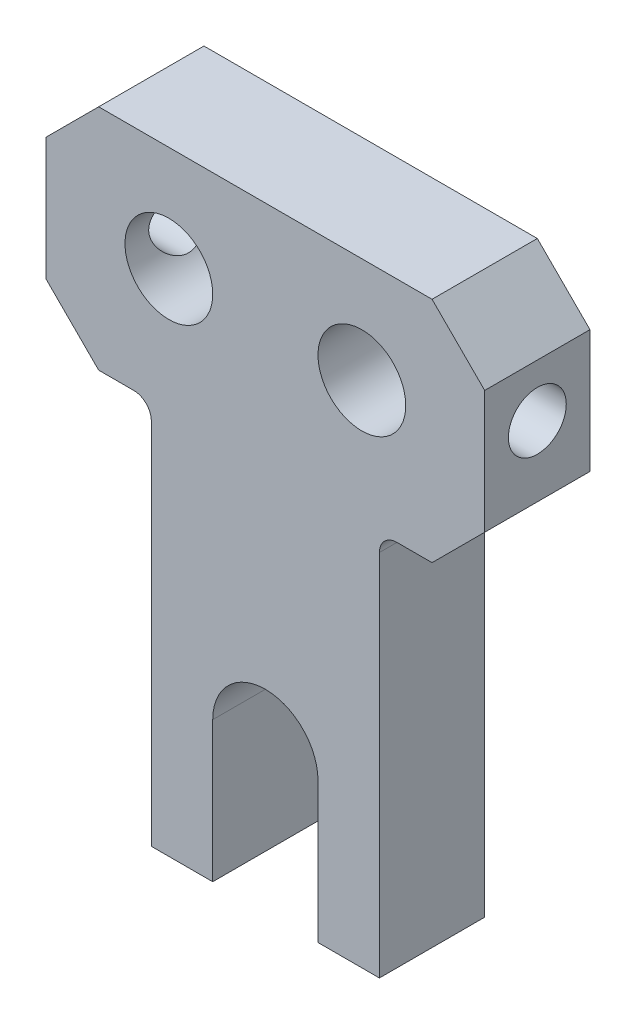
ISO-10303-21;
HEADER;
FILE_DESCRIPTION(('STEP AP214'),'2;1');
FILE_NAME('part.step','',(''),(''),'','','');
FILE_SCHEMA(('AUTOMOTIVE_DESIGN { 1 0 10303 214 1 1 1 1 }'));
ENDSEC;
DATA;
#1=APPLICATION_CONTEXT('core data for automotive mechanical design processes');
#2=APPLICATION_PROTOCOL_DEFINITION('international standard','automotive_design',2000,#1);
#3=PRODUCT_CONTEXT('',#1,'mechanical');
#4=PRODUCT('Part','Part','',(#3));
#5=PRODUCT_RELATED_PRODUCT_CATEGORY('part','',(#4));
#6=PRODUCT_DEFINITION_FORMATION('','',#4);
#7=PRODUCT_DEFINITION_CONTEXT('part definition',#1,'design');
#8=PRODUCT_DEFINITION('design','',#6,#7);
#9=PRODUCT_DEFINITION_SHAPE('','',#8);
#10=(LENGTH_UNIT() NAMED_UNIT(*) SI_UNIT(.MILLI.,.METRE.));
#11=(NAMED_UNIT(*) PLANE_ANGLE_UNIT() SI_UNIT($,.RADIAN.));
#12=(NAMED_UNIT(*) SI_UNIT($,.STERADIAN.) SOLID_ANGLE_UNIT());
#13=UNCERTAINTY_MEASURE_WITH_UNIT(LENGTH_MEASURE(1.E-05),#10,'distance_accuracy_value','');
#14=(GEOMETRIC_REPRESENTATION_CONTEXT(3) GLOBAL_UNCERTAINTY_ASSIGNED_CONTEXT((#13)) GLOBAL_UNIT_ASSIGNED_CONTEXT((#10,
#11,#12)) REPRESENTATION_CONTEXT('',''));
#15=CARTESIAN_POINT('',(0.,0.,0.));
#16=DIRECTION('',(0.,0.,1.));
#17=DIRECTION('',(1.,0.,0.));
#18=AXIS2_PLACEMENT_3D('',#15,#16,#17);
#19=CARTESIAN_POINT('',(0.,-107.763002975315,6.));
#20=DIRECTION('',(0.,1.,0.));
#21=DIRECTION('',(0.,0.,1.));
#22=AXIS2_PLACEMENT_3D('',#19,#20,#21);
#23=PLANE('',#22);
#24=DIRECTION('',(1.,0.,0.));
#25=VECTOR('',#24,1.);
#26=CARTESIAN_POINT('',(0.,-107.763002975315,0.));
#27=LINE('',#26,#25);
#28=CARTESIAN_POINT('',(6.,-107.763002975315,0.));
#29=VERTEX_POINT('',#28);
#30=CARTESIAN_POINT('',(9.5,-107.763002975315,0.));
#31=VERTEX_POINT('',#30);
#32=EDGE_CURVE('E167',#29,#31,#27,.T.);
#33=ORIENTED_EDGE('',*,*,#32,.T.);
#34=DIRECTION('',(0.,0.,1.));
#35=VECTOR('',#34,1.);
#36=CARTESIAN_POINT('',(9.5,-107.763002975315,0.));
#37=LINE('',#36,#35);
#38=CARTESIAN_POINT('',(9.5,-107.763002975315,6.));
#39=VERTEX_POINT('',#38);
#40=EDGE_CURVE('E379',#31,#39,#37,.T.);
#41=ORIENTED_EDGE('',*,*,#40,.T.);
#42=DIRECTION('',(1.,0.,0.));
#43=VECTOR('',#42,1.);
#44=CARTESIAN_POINT('',(0.,-107.763002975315,6.));
#45=LINE('',#44,#43);
#46=CARTESIAN_POINT('',(6.,-107.763002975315,6.));
#47=VERTEX_POINT('',#46);
#48=EDGE_CURVE('E299',#47,#39,#45,.T.);
#49=ORIENTED_EDGE('',*,*,#48,.F.);
#50=DIRECTION('',(0.,0.,1.));
#51=VECTOR('',#50,1.);
#52=CARTESIAN_POINT('',(6.,-107.763002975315,0.));
#53=LINE('',#52,#51);
#54=EDGE_CURVE('E394',#29,#47,#53,.T.);
#55=ORIENTED_EDGE('',*,*,#54,.F.);
#56=EDGE_LOOP('',(#33,#41,#49,#55));
#57=FACE_BOUND('',#56,.T.);
#58=ADVANCED_FACE('F16',(#57),#23,.F.);
#59=CARTESIAN_POINT('',(0.,-72.7630029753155,6.));
#60=DIRECTION('',(1.,0.,0.));
#61=DIRECTION('',(0.,1.,0.));
#62=AXIS2_PLACEMENT_3D('',#59,#60,#61);
#63=PLANE('',#62);
#64=CARTESIAN_POINT('',(0.,-78.7630029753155,3.));
#65=DIRECTION('',(-1.,0.,0.));
#66=DIRECTION('',(0.,0.,1.));
#67=AXIS2_PLACEMENT_3D('',#64,#65,#66);
#68=CIRCLE('',#67,1.65);
#69=CARTESIAN_POINT('',(0.,-78.7630029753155,4.65));
#70=VERTEX_POINT('',#69);
#71=EDGE_CURVE('E419',#70,#70,#68,.T.);
#72=ORIENTED_EDGE('',*,*,#71,.F.);
#73=EDGE_LOOP('',(#72));
#74=FACE_BOUND('',#73,.T.);
#75=DIRECTION('',(0.,-1.,0.));
#76=VECTOR('',#75,1.);
#77=CARTESIAN_POINT('',(0.,-72.7630029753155,0.));
#78=LINE('',#77,#76);
#79=CARTESIAN_POINT('',(0.,-75.7630029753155,0.));
#80=VERTEX_POINT('',#79);
#81=CARTESIAN_POINT('',(0.,-82.7630029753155,0.));
#82=VERTEX_POINT('',#81);
#83=EDGE_CURVE('E168',#80,#82,#78,.T.);
#84=ORIENTED_EDGE('',*,*,#83,.T.);
#85=DIRECTION('',(0.,0.,1.));
#86=VECTOR('',#85,1.);
#87=CARTESIAN_POINT('',(0.,-82.7630029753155,6.));
#88=LINE('',#87,#86);
#89=CARTESIAN_POINT('',(0.,-82.7630029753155,6.));
#90=VERTEX_POINT('',#89);
#91=EDGE_CURVE('E310',#82,#90,#88,.T.);
#92=ORIENTED_EDGE('',*,*,#91,.T.);
#93=DIRECTION('',(0.,-1.,0.));
#94=VECTOR('',#93,1.);
#95=CARTESIAN_POINT('',(0.,-72.7630029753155,6.));
#96=LINE('',#95,#94);
#97=CARTESIAN_POINT('',(0.,-75.7630029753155,6.));
#98=VERTEX_POINT('',#97);
#99=EDGE_CURVE('E182',#98,#90,#96,.T.);
#100=ORIENTED_EDGE('',*,*,#99,.F.);
#101=DIRECTION('',(0.,0.,-1.));
#102=VECTOR('',#101,1.);
#103=CARTESIAN_POINT('',(0.,-75.7630029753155,6.));
#104=LINE('',#103,#102);
#105=EDGE_CURVE('E306',#98,#80,#104,.T.);
#106=ORIENTED_EDGE('',*,*,#105,.T.);
#107=EDGE_LOOP('',(#84,#92,#100,#106));
#108=FACE_BOUND('',#107,.T.);
#109=ADVANCED_FACE('F238',(#74,#108),#63,.F.);
#110=CARTESIAN_POINT('',(15.5,-107.763002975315,6.));
#111=VERTEX_POINT('',#110);
#112=CARTESIAN_POINT('',(19.,-107.763002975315,6.));
#113=VERTEX_POINT('',#112);
#114=EDGE_CURVE('E161',#111,#113,#45,.T.);
#115=ORIENTED_EDGE('',*,*,#114,.F.);
#116=DIRECTION('',(0.,0.,1.));
#117=VECTOR('',#116,1.);
#118=CARTESIAN_POINT('',(15.5,-107.763002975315,0.));
#119=LINE('',#118,#117);
#120=CARTESIAN_POINT('',(15.5,-107.763002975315,0.));
#121=VERTEX_POINT('',#120);
#122=EDGE_CURVE('E144',#121,#111,#119,.T.);
#123=ORIENTED_EDGE('',*,*,#122,.F.);
#124=CARTESIAN_POINT('',(19.,-107.763002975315,0.));
#125=VERTEX_POINT('',#124);
#126=EDGE_CURVE('E158',#121,#125,#27,.T.);
#127=ORIENTED_EDGE('',*,*,#126,.T.);
#128=DIRECTION('',(0.,0.,1.));
#129=VECTOR('',#128,1.);
#130=CARTESIAN_POINT('',(19.,-107.763002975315,0.));
#131=LINE('',#130,#129);
#132=EDGE_CURVE('E370',#125,#113,#131,.T.);
#133=ORIENTED_EDGE('',*,*,#132,.T.);
#134=EDGE_LOOP('',(#115,#123,#127,#133));
#135=FACE_BOUND('',#134,.T.);
#136=ADVANCED_FACE('F156',(#135),#23,.F.);
#137=CARTESIAN_POINT('',(25.,-72.7630029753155,6.));
#138=DIRECTION('',(-1.,0.,0.));
#139=DIRECTION('',(0.,0.,1.));
#140=AXIS2_PLACEMENT_3D('',#137,#138,#139);
#141=PLANE('',#140);
#142=CARTESIAN_POINT('',(25.,-78.7630029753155,3.));
#143=DIRECTION('',(1.,0.,0.));
#144=DIRECTION('',(0.,0.,-1.));
#145=AXIS2_PLACEMENT_3D('',#142,#143,#144);
#146=CIRCLE('',#145,1.65);
#147=CARTESIAN_POINT('',(25.,-78.7630029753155,1.35));
#148=VERTEX_POINT('',#147);
#149=EDGE_CURVE('E192',#148,#148,#146,.T.);
#150=ORIENTED_EDGE('',*,*,#149,.F.);
#151=EDGE_LOOP('',(#150));
#152=FACE_BOUND('',#151,.T.);
#153=DIRECTION('',(0.,1.,0.));
#154=VECTOR('',#153,1.);
#155=CARTESIAN_POINT('',(25.,-72.7630029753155,6.));
#156=LINE('',#155,#154);
#157=CARTESIAN_POINT('',(25.,-82.7630029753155,6.));
#158=VERTEX_POINT('',#157);
#159=CARTESIAN_POINT('',(25.,-75.7630029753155,6.));
#160=VERTEX_POINT('',#159);
#161=EDGE_CURVE('E302',#158,#160,#156,.T.);
#162=ORIENTED_EDGE('',*,*,#161,.F.);
#163=DIRECTION('',(0.,0.,-1.));
#164=VECTOR('',#163,1.);
#165=CARTESIAN_POINT('',(25.,-82.7630029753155,6.));
#166=LINE('',#165,#164);
#167=CARTESIAN_POINT('',(25.,-82.7630029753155,0.));
#168=VERTEX_POINT('',#167);
#169=EDGE_CURVE('E348',#158,#168,#166,.T.);
#170=ORIENTED_EDGE('',*,*,#169,.T.);
#171=DIRECTION('',(0.,1.,0.));
#172=VECTOR('',#171,1.);
#173=CARTESIAN_POINT('',(25.,-72.7630029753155,0.));
#174=LINE('',#173,#172);
#175=CARTESIAN_POINT('',(25.,-75.7630029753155,0.));
#176=VERTEX_POINT('',#175);
#177=EDGE_CURVE('E171',#168,#176,#174,.T.);
#178=ORIENTED_EDGE('',*,*,#177,.T.);
#179=DIRECTION('',(0.,0.,1.));
#180=VECTOR('',#179,1.);
#181=CARTESIAN_POINT('',(25.,-75.7630029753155,6.));
#182=LINE('',#181,#180);
#183=EDGE_CURVE('E346',#176,#160,#182,.T.);
#184=ORIENTED_EDGE('',*,*,#183,.T.);
#185=EDGE_LOOP('',(#162,#170,#178,#184));
#186=FACE_BOUND('',#185,.T.);
#187=ADVANCED_FACE('F249',(#152,#186),#141,.F.);
#188=CARTESIAN_POINT('',(0.,-72.7630029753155,6.));
#189=DIRECTION('',(0.,-1.,0.));
#190=DIRECTION('',(0.,0.,-1.));
#191=AXIS2_PLACEMENT_3D('',#188,#189,#190);
#192=PLANE('',#191);
#193=DIRECTION('',(-1.,0.,0.));
#194=VECTOR('',#193,1.);
#195=CARTESIAN_POINT('',(0.,-72.7630029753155,0.));
#196=LINE('',#195,#194);
#197=CARTESIAN_POINT('',(22.,-72.7630029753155,0.));
#198=VERTEX_POINT('',#197);
#199=CARTESIAN_POINT('',(3.,-72.7630029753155,0.));
#200=VERTEX_POINT('',#199);
#201=EDGE_CURVE('E179',#198,#200,#196,.T.);
#202=ORIENTED_EDGE('',*,*,#201,.T.);
#203=DIRECTION('',(0.,0.,1.));
#204=VECTOR('',#203,1.);
#205=CARTESIAN_POINT('',(3.,-72.7630029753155,6.));
#206=LINE('',#205,#204);
#207=CARTESIAN_POINT('',(3.,-72.7630029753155,6.));
#208=VERTEX_POINT('',#207);
#209=EDGE_CURVE('E341',#200,#208,#206,.T.);
#210=ORIENTED_EDGE('',*,*,#209,.T.);
#211=DIRECTION('',(-1.,0.,0.));
#212=VECTOR('',#211,1.);
#213=CARTESIAN_POINT('',(0.,-72.7630029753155,6.));
#214=LINE('',#213,#212);
#215=CARTESIAN_POINT('',(22.,-72.7630029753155,6.));
#216=VERTEX_POINT('',#215);
#217=EDGE_CURVE('E304',#216,#208,#214,.T.);
#218=ORIENTED_EDGE('',*,*,#217,.F.);
#219=DIRECTION('',(0.,0.,-1.));
#220=VECTOR('',#219,1.);
#221=CARTESIAN_POINT('',(22.,-72.7630029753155,6.));
#222=LINE('',#221,#220);
#223=EDGE_CURVE('E338',#216,#198,#222,.T.);
#224=ORIENTED_EDGE('',*,*,#223,.T.);
#225=EDGE_LOOP('',(#202,#210,#218,#224));
#226=FACE_BOUND('',#225,.T.);
#227=ADVANCED_FACE('F254',(#226),#192,.F.);
#228=CARTESIAN_POINT('',(0.,0.,6.));
#229=DIRECTION('',(0.,0.,1.));
#230=DIRECTION('',(1.,0.,0.));
#231=AXIS2_PLACEMENT_3D('',#228,#229,#230);
#232=PLANE('',#231);
#233=ORIENTED_EDGE('',*,*,#99,.T.);
#234=DIRECTION('',(-0.70710678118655,0.707106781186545,0.));
#235=VECTOR('',#234,1.);
#236=CARTESIAN_POINT('',(-41.3815014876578,-41.381501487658,6.));
#237=LINE('',#236,#235);
#238=CARTESIAN_POINT('',(3.,-85.7630029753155,6.));
#239=VERTEX_POINT('',#238);
#240=EDGE_CURVE('E324',#90,#239,#237,.F.);
#241=ORIENTED_EDGE('',*,*,#240,.T.);
#242=DIRECTION('',(-1.,0.,0.));
#243=VECTOR('',#242,1.);
#244=CARTESIAN_POINT('',(0.,-85.7630029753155,6.));
#245=LINE('',#244,#243);
#246=CARTESIAN_POINT('',(5.,-85.7630029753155,6.));
#247=VERTEX_POINT('',#246);
#248=EDGE_CURVE('E392',#247,#239,#245,.T.);
#249=ORIENTED_EDGE('',*,*,#248,.F.);
#250=CARTESIAN_POINT('',(5.,-86.7630029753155,6.));
#251=DIRECTION('',(0.,0.,1.));
#252=DIRECTION('',(1.,0.,0.));
#253=AXIS2_PLACEMENT_3D('',#250,#251,#252);
#254=CIRCLE('',#253,1.);
#255=CARTESIAN_POINT('',(6.,-86.7630029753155,6.));
#256=VERTEX_POINT('',#255);
#257=EDGE_CURVE('E24',#247,#256,#254,.F.);
#258=ORIENTED_EDGE('',*,*,#257,.T.);
#259=DIRECTION('',(0.,1.,0.));
#260=VECTOR('',#259,1.);
#261=CARTESIAN_POINT('',(6.,-107.763002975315,6.));
#262=LINE('',#261,#260);
#263=EDGE_CURVE('E388',#47,#256,#262,.T.);
#264=ORIENTED_EDGE('',*,*,#263,.F.);
#265=ORIENTED_EDGE('',*,*,#48,.T.);
#266=DIRECTION('',(0.,-1.,0.));
#267=VECTOR('',#266,1.);
#268=CARTESIAN_POINT('',(9.5,-107.763002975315,6.));
#269=LINE('',#268,#267);
#270=CARTESIAN_POINT('',(9.5,-99.7630029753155,6.));
#271=VERTEX_POINT('',#270);
#272=EDGE_CURVE('E151',#271,#39,#269,.T.);
#273=ORIENTED_EDGE('',*,*,#272,.F.);
#274=CARTESIAN_POINT('',(12.5,-99.7630029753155,6.));
#275=DIRECTION('',(0.,0.,1.));
#276=DIRECTION('',(1.,0.,0.));
#277=AXIS2_PLACEMENT_3D('',#274,#275,#276);
#278=CIRCLE('',#277,3.);
#279=CARTESIAN_POINT('',(15.5,-99.7630029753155,6.));
#280=VERTEX_POINT('',#279);
#281=EDGE_CURVE('E410',#280,#271,#278,.T.);
#282=ORIENTED_EDGE('',*,*,#281,.F.);
#283=DIRECTION('',(0.,1.,0.));
#284=VECTOR('',#283,1.);
#285=CARTESIAN_POINT('',(15.5,-107.763002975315,6.));
#286=LINE('',#285,#284);
#287=EDGE_CURVE('E191',#111,#280,#286,.T.);
#288=ORIENTED_EDGE('',*,*,#287,.F.);
#289=ORIENTED_EDGE('',*,*,#114,.T.);
#290=DIRECTION('',(0.,-1.,0.));
#291=VECTOR('',#290,1.);
#292=CARTESIAN_POINT('',(19.,-107.763002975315,6.));
#293=LINE('',#292,#291);
#294=CARTESIAN_POINT('',(19.,-86.7630029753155,6.));
#295=VERTEX_POINT('',#294);
#296=EDGE_CURVE('E377',#295,#113,#293,.T.);
#297=ORIENTED_EDGE('',*,*,#296,.F.);
#298=CARTESIAN_POINT('',(20.,-86.7630029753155,6.));
#299=DIRECTION('',(0.,0.,1.));
#300=DIRECTION('',(1.,0.,0.));
#301=AXIS2_PLACEMENT_3D('',#298,#299,#300);
#302=CIRCLE('',#301,1.);
#303=CARTESIAN_POINT('',(20.,-85.7630029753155,6.));
#304=VERTEX_POINT('',#303);
#305=EDGE_CURVE('E359',#295,#304,#302,.F.);
#306=ORIENTED_EDGE('',*,*,#305,.T.);
#307=DIRECTION('',(-1.,0.,0.));
#308=VECTOR('',#307,1.);
#309=CARTESIAN_POINT('',(25.,-85.7630029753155,6.));
#310=LINE('',#309,#308);
#311=CARTESIAN_POINT('',(22.,-85.7630029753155,6.));
#312=VERTEX_POINT('',#311);
#313=EDGE_CURVE('E376',#312,#304,#310,.T.);
#314=ORIENTED_EDGE('',*,*,#313,.F.);
#315=DIRECTION('',(-0.707106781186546,-0.707106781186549,0.));
#316=VECTOR('',#315,1.);
#317=CARTESIAN_POINT('',(53.8815014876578,-53.8815014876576,6.));
#318=LINE('',#317,#316);
#319=EDGE_CURVE('E320',#312,#158,#318,.F.);
#320=ORIENTED_EDGE('',*,*,#319,.T.);
#321=ORIENTED_EDGE('',*,*,#161,.T.);
#322=DIRECTION('',(0.707106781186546,-0.707106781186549,0.));
#323=VECTOR('',#322,1.);
#324=CARTESIAN_POINT('',(-25.3815014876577,-25.3815014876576,6.));
#325=LINE('',#324,#323);
#326=EDGE_CURVE('E316',#160,#216,#325,.F.);
#327=ORIENTED_EDGE('',*,*,#326,.T.);
#328=ORIENTED_EDGE('',*,*,#217,.T.);
#329=DIRECTION('',(0.70710678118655,0.707106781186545,0.));
#330=VECTOR('',#329,1.);
#331=CARTESIAN_POINT('',(37.8815014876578,-37.881501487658,6.));
#332=LINE('',#331,#330);
#333=EDGE_CURVE('E322',#208,#98,#332,.F.);
#334=ORIENTED_EDGE('',*,*,#333,.T.);
#335=EDGE_LOOP('',(#233,#241,#249,#258,#264,#265,#273,#282,#288,#289,#297,#306,#314,#320,#321,
#327,#328,#334));
#336=FACE_BOUND('',#335,.T.);
#337=CARTESIAN_POINT('',(18.,-78.7630029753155,6.));
#338=DIRECTION('',(0.,0.,1.));
#339=DIRECTION('',(1.,0.,0.));
#340=AXIS2_PLACEMENT_3D('',#337,#338,#339);
#341=CIRCLE('',#340,2.5);
#342=CARTESIAN_POINT('',(20.5,-78.7630029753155,6.));
#343=VERTEX_POINT('',#342);
#344=EDGE_CURVE('E293',#343,#343,#341,.T.);
#345=ORIENTED_EDGE('',*,*,#344,.F.);
#346=EDGE_LOOP('',(#345));
#347=FACE_BOUND('',#346,.T.);
#348=CARTESIAN_POINT('',(7.,-78.7630029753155,6.));
#349=DIRECTION('',(0.,0.,1.));
#350=DIRECTION('',(1.,0.,0.));
#351=AXIS2_PLACEMENT_3D('',#348,#349,#350);
#352=CIRCLE('',#351,2.5);
#353=CARTESIAN_POINT('',(9.5,-78.7630029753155,6.));
#354=VERTEX_POINT('',#353);
#355=EDGE_CURVE('E287',#354,#354,#352,.T.);
#356=ORIENTED_EDGE('',*,*,#355,.F.);
#357=EDGE_LOOP('',(#356));
#358=FACE_BOUND('',#357,.T.);
#359=ADVANCED_FACE('F260',(#336,#347,#358),#232,.T.);
#360=CARTESIAN_POINT('',(0.,0.,0.));
#361=DIRECTION('',(0.,0.,1.));
#362=DIRECTION('',(1.,0.,0.));
#363=AXIS2_PLACEMENT_3D('',#360,#361,#362);
#364=PLANE('',#363);
#365=CARTESIAN_POINT('',(18.,-78.7630029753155,0.));
#366=DIRECTION('',(0.,0.,1.));
#367=DIRECTION('',(1.,0.,0.));
#368=AXIS2_PLACEMENT_3D('',#365,#366,#367);
#369=CIRCLE('',#368,2.5);
#370=CARTESIAN_POINT('',(20.5,-78.7630029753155,0.));
#371=VERTEX_POINT('',#370);
#372=EDGE_CURVE('E289',#371,#371,#369,.T.);
#373=ORIENTED_EDGE('',*,*,#372,.T.);
#374=EDGE_LOOP('',(#373));
#375=FACE_BOUND('',#374,.T.);
#376=CARTESIAN_POINT('',(7.,-78.7630029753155,0.));
#377=DIRECTION('',(0.,0.,1.));
#378=DIRECTION('',(1.,0.,0.));
#379=AXIS2_PLACEMENT_3D('',#376,#377,#378);
#380=CIRCLE('',#379,2.5);
#381=CARTESIAN_POINT('',(9.5,-78.7630029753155,0.));
#382=VERTEX_POINT('',#381);
#383=EDGE_CURVE('E173',#382,#382,#380,.T.);
#384=ORIENTED_EDGE('',*,*,#383,.T.);
#385=EDGE_LOOP('',(#384));
#386=FACE_BOUND('',#385,.T.);
#387=DIRECTION('',(0.,1.,0.));
#388=VECTOR('',#387,1.);
#389=CARTESIAN_POINT('',(6.,-107.763002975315,0.));
#390=LINE('',#389,#388);
#391=CARTESIAN_POINT('',(6.,-86.7630029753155,0.));
#392=VERTEX_POINT('',#391);
#393=EDGE_CURVE('E389',#29,#392,#390,.T.);
#394=ORIENTED_EDGE('',*,*,#393,.T.);
#395=CARTESIAN_POINT('',(5.,-86.7630029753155,0.));
#396=DIRECTION('',(0.,0.,1.));
#397=DIRECTION('',(1.,0.,0.));
#398=AXIS2_PLACEMENT_3D('',#395,#396,#397);
#399=CIRCLE('',#398,1.);
#400=CARTESIAN_POINT('',(5.,-85.7630029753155,0.));
#401=VERTEX_POINT('',#400);
#402=EDGE_CURVE('E11',#392,#401,#399,.T.);
#403=ORIENTED_EDGE('',*,*,#402,.T.);
#404=DIRECTION('',(-1.,0.,0.));
#405=VECTOR('',#404,1.);
#406=CARTESIAN_POINT('',(0.,-85.7630029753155,0.));
#407=LINE('',#406,#405);
#408=CARTESIAN_POINT('',(3.,-85.7630029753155,0.));
#409=VERTEX_POINT('',#408);
#410=EDGE_CURVE('E391',#401,#409,#407,.T.);
#411=ORIENTED_EDGE('',*,*,#410,.T.);
#412=DIRECTION('',(0.70710678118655,-0.707106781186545,0.));
#413=VECTOR('',#412,1.);
#414=CARTESIAN_POINT('',(0.,-82.7630029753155,0.));
#415=LINE('',#414,#413);
#416=EDGE_CURVE('E336',#409,#82,#415,.F.);
#417=ORIENTED_EDGE('',*,*,#416,.T.);
#418=ORIENTED_EDGE('',*,*,#83,.F.);
#419=DIRECTION('',(-0.70710678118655,-0.707106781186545,0.));
#420=VECTOR('',#419,1.);
#421=CARTESIAN_POINT('',(0.,-75.7630029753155,0.));
#422=LINE('',#421,#420);
#423=EDGE_CURVE('E334',#80,#200,#422,.F.);
#424=ORIENTED_EDGE('',*,*,#423,.T.);
#425=ORIENTED_EDGE('',*,*,#201,.F.);
#426=DIRECTION('',(-0.707106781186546,0.707106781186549,0.));
#427=VECTOR('',#426,1.);
#428=CARTESIAN_POINT('',(22.,-72.7630029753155,0.));
#429=LINE('',#428,#427);
#430=EDGE_CURVE('E330',#198,#176,#429,.F.);
#431=ORIENTED_EDGE('',*,*,#430,.T.);
#432=ORIENTED_EDGE('',*,*,#177,.F.);
#433=DIRECTION('',(0.707106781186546,0.707106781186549,0.));
#434=VECTOR('',#433,1.);
#435=CARTESIAN_POINT('',(22.,-85.7630029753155,0.));
#436=LINE('',#435,#434);
#437=CARTESIAN_POINT('',(22.,-85.7630029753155,0.));
#438=VERTEX_POINT('',#437);
#439=EDGE_CURVE('E332',#168,#438,#436,.F.);
#440=ORIENTED_EDGE('',*,*,#439,.T.);
#441=DIRECTION('',(-1.,0.,0.));
#442=VECTOR('',#441,1.);
#443=CARTESIAN_POINT('',(25.,-85.7630029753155,0.));
#444=LINE('',#443,#442);
#445=CARTESIAN_POINT('',(20.,-85.7630029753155,0.));
#446=VERTEX_POINT('',#445);
#447=EDGE_CURVE('E365',#438,#446,#444,.T.);
#448=ORIENTED_EDGE('',*,*,#447,.T.);
#449=CARTESIAN_POINT('',(20.,-86.7630029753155,0.));
#450=DIRECTION('',(0.,0.,1.));
#451=DIRECTION('',(1.,0.,0.));
#452=AXIS2_PLACEMENT_3D('',#449,#450,#451);
#453=CIRCLE('',#452,1.);
#454=CARTESIAN_POINT('',(19.,-86.7630029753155,0.));
#455=VERTEX_POINT('',#454);
#456=EDGE_CURVE('E361',#446,#455,#453,.T.);
#457=ORIENTED_EDGE('',*,*,#456,.T.);
#458=DIRECTION('',(0.,-1.,0.));
#459=VECTOR('',#458,1.);
#460=CARTESIAN_POINT('',(19.,-107.763002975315,0.));
#461=LINE('',#460,#459);
#462=EDGE_CURVE('E166',#455,#125,#461,.T.);
#463=ORIENTED_EDGE('',*,*,#462,.T.);
#464=ORIENTED_EDGE('',*,*,#126,.F.);
#465=DIRECTION('',(0.,1.,0.));
#466=VECTOR('',#465,1.);
#467=CARTESIAN_POINT('',(15.5,-107.763002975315,0.));
#468=LINE('',#467,#466);
#469=CARTESIAN_POINT('',(15.5,-99.7630029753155,0.));
#470=VERTEX_POINT('',#469);
#471=EDGE_CURVE('E140',#121,#470,#468,.T.);
#472=ORIENTED_EDGE('',*,*,#471,.T.);
#473=CARTESIAN_POINT('',(12.5,-99.7630029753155,0.));
#474=DIRECTION('',(0.,0.,1.));
#475=DIRECTION('',(1.,0.,0.));
#476=AXIS2_PLACEMENT_3D('',#473,#474,#475);
#477=CIRCLE('',#476,3.);
#478=CARTESIAN_POINT('',(9.5,-99.7630029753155,0.));
#479=VERTEX_POINT('',#478);
#480=EDGE_CURVE('E150',#470,#479,#477,.T.);
#481=ORIENTED_EDGE('',*,*,#480,.T.);
#482=DIRECTION('',(0.,-1.,0.));
#483=VECTOR('',#482,1.);
#484=CARTESIAN_POINT('',(9.5,-107.763002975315,0.));
#485=LINE('',#484,#483);
#486=EDGE_CURVE('E162',#479,#31,#485,.T.);
#487=ORIENTED_EDGE('',*,*,#486,.T.);
#488=ORIENTED_EDGE('',*,*,#32,.F.);
#489=EDGE_LOOP('',(#394,#403,#411,#417,#418,#424,#425,#431,#432,#440,#448,#457,#463,#464,#472,
#481,#487,#488));
#490=FACE_BOUND('',#489,.T.);
#491=ADVANCED_FACE('F164',(#375,#386,#490),#364,.F.);
#492=CARTESIAN_POINT('',(7.,-78.7630029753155,0.));
#493=DIRECTION('',(0.,0.,1.));
#494=DIRECTION('',(1.,0.,0.));
#495=AXIS2_PLACEMENT_3D('',#492,#493,#494);
#496=CYLINDRICAL_SURFACE('',#495,2.5);
#497=CARTESIAN_POINT('',(4.5,-78.7630029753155,4.65));
#498=CARTESIAN_POINT('',(4.50000126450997,-78.6799455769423,4.64999873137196));
#499=CARTESIAN_POINT('',(4.50417590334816,-78.5968759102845,4.64369332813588));
#500=CARTESIAN_POINT('',(4.52046206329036,-78.43337541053,4.61885588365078));
#501=CARTESIAN_POINT('',(4.53257847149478,-78.3529462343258,4.60031631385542));
#502=CARTESIAN_POINT('',(4.56354921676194,-78.1973361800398,4.5521372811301));
#503=CARTESIAN_POINT('',(4.58237189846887,-78.1221325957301,4.52254993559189));
#504=CARTESIAN_POINT('',(4.62523480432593,-77.9780520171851,4.45352693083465));
#505=CARTESIAN_POINT('',(4.64927570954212,-77.909175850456,4.41408998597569));
#506=CARTESIAN_POINT('',(4.70304338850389,-77.7731661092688,4.32286952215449));
#507=CARTESIAN_POINT('',(4.73307831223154,-77.7066662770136,4.27032656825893));
#508=CARTESIAN_POINT('',(4.79501154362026,-77.5828201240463,4.15618952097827));
#509=CARTESIAN_POINT('',(4.82691244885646,-77.5254869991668,4.09458262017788));
#510=CARTESIAN_POINT('',(4.89493215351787,-77.4125714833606,3.95302539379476));
#511=CARTESIAN_POINT('',(4.93094323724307,-77.3586208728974,3.87171133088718));
#512=CARTESIAN_POINT('',(4.99750748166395,-77.2652330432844,3.69912083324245));
#513=CARTESIAN_POINT('',(5.02807003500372,-77.2257707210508,3.60786198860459));
#514=CARTESIAN_POINT('',(5.07115995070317,-77.1722780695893,3.44413560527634));
#515=CARTESIAN_POINT('',(5.08634429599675,-77.1542077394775,3.37369396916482));
#516=CARTESIAN_POINT('',(5.10914156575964,-77.1274689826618,3.22990185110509));
#517=CARTESIAN_POINT('',(5.11676714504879,-77.1187848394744,3.15655644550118));
#518=CARTESIAN_POINT('',(5.1232724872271,-77.1113603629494,3.00867667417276));
#519=CARTESIAN_POINT('',(5.12211886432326,-77.1126579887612,2.93413884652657));
#520=CARTESIAN_POINT('',(5.1111810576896,-77.1251918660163,2.78652353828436));
#521=CARTESIAN_POINT('',(5.10138958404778,-77.1364365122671,2.71344734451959));
#522=CARTESIAN_POINT('',(5.0752285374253,-77.1674967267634,2.57363241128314));
#523=CARTESIAN_POINT('',(5.05913987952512,-77.1869487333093,2.50675695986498));
#524=CARTESIAN_POINT('',(5.02222991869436,-77.2335238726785,2.37715045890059));
#525=CARTESIAN_POINT('',(5.00140706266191,-77.2606495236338,2.31442077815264));
#526=CARTESIAN_POINT('',(4.95232655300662,-77.3280473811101,2.18145090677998));
#527=CARTESIAN_POINT('',(4.92341588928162,-77.3698664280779,2.112237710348));
#528=CARTESIAN_POINT('',(4.8640181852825,-77.4627609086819,1.98100806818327));
#529=CARTESIAN_POINT('',(4.83352924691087,-77.5138476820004,1.91900059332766));
#530=CARTESIAN_POINT('',(4.76704742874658,-77.6361862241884,1.79079581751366));
#531=CARTESIAN_POINT('',(4.73122080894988,-77.7094232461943,1.72638563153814));
#532=CARTESIAN_POINT('',(4.66430895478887,-77.8675178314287,1.61069375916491));
#533=CARTESIAN_POINT('',(4.63321910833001,-77.9523639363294,1.55939926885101));
#534=CARTESIAN_POINT('',(4.58446418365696,-78.1142635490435,1.4807693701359));
#535=CARTESIAN_POINT('',(4.56536086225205,-78.1895565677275,1.45070429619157));
#536=CARTESIAN_POINT('',(4.5339165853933,-78.3450269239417,1.40174403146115));
#537=CARTESIAN_POINT('',(4.52156997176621,-78.4252001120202,1.38283949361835));
#538=CARTESIAN_POINT('',(4.50473096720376,-78.5886362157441,1.35714787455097));
#539=CARTESIAN_POINT('',(4.50027049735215,-78.6719103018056,1.35041003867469));
#540=CARTESIAN_POINT('',(4.49975367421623,-78.8385484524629,1.34962658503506));
#541=CARTESIAN_POINT('',(4.50369704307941,-78.9219125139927,1.35558054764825));
#542=CARTESIAN_POINT('',(4.51905723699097,-79.0805939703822,1.37899822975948));
#543=CARTESIAN_POINT('',(4.5299651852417,-79.1560798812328,1.39567875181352));
#544=CARTESIAN_POINT('',(4.55785818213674,-79.3029430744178,1.43896514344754));
#545=CARTESIAN_POINT('',(4.5748442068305,-79.3743196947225,1.46557260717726));
#546=CARTESIAN_POINT('',(4.61490711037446,-79.5160648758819,1.52968198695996));
#547=CARTESIAN_POINT('',(4.63830561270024,-79.5860729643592,1.56777480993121));
#548=CARTESIAN_POINT('',(4.68889612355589,-79.7189654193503,1.65282892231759));
#549=CARTESIAN_POINT('',(4.71609063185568,-79.7818450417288,1.69979606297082));
#550=CARTESIAN_POINT('',(4.77691400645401,-79.9091313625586,1.80961080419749));
#551=CARTESIAN_POINT('',(4.81088232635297,-79.9722242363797,1.87379416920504));
#552=CARTESIAN_POINT('',(4.87851672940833,-80.0873009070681,2.01166557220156));
#553=CARTESIAN_POINT('',(4.91218262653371,-80.139278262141,2.08535908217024));
#554=CARTESIAN_POINT('',(4.97254094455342,-80.2265393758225,2.23370339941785));
#555=CARTESIAN_POINT('',(4.99959392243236,-80.2629694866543,2.30752954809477));
#556=CARTESIAN_POINT('',(5.04752140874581,-80.3248501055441,2.46149631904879));
#557=CARTESIAN_POINT('',(5.06840705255,-80.3503204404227,2.5416252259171));
#558=CARTESIAN_POINT('',(5.09806726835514,-80.3856849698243,2.692798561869));
#559=CARTESIAN_POINT('',(5.10828682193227,-80.3974768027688,2.76310833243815));
#560=CARTESIAN_POINT('',(5.12078129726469,-80.4118312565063,2.90533882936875));
#561=CARTESIAN_POINT('',(5.12306383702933,-80.4144027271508,2.97725794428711));
#562=CARTESIAN_POINT('',(5.11933394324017,-80.4101522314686,3.1205911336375));
#563=CARTESIAN_POINT('',(5.11332122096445,-80.4033299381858,3.19200519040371));
#564=CARTESIAN_POINT('',(5.09392209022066,-80.3807424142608,3.33240243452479));
#565=CARTESIAN_POINT('',(5.08052595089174,-80.3649653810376,3.40138228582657));
#566=CARTESIAN_POINT('',(5.0435548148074,-80.3197265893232,3.55417079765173));
#567=CARTESIAN_POINT('',(5.018185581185,-80.2876801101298,3.63677236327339));
#568=CARTESIAN_POINT('',(4.9620833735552,-80.2118359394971,3.7943942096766));
#569=CARTESIAN_POINT('',(4.93134296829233,-80.1680219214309,3.8694037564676));
#570=CARTESIAN_POINT('',(4.86735067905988,-80.0688927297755,4.01234437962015));
#571=CARTESIAN_POINT('',(4.83406471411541,-80.0133928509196,4.08013166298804));
#572=CARTESIAN_POINT('',(4.76843437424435,-79.8921058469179,4.20635347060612));
#573=CARTESIAN_POINT('',(4.73609027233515,-79.8263157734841,4.26478530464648));
#574=CARTESIAN_POINT('',(4.67115514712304,-79.6762270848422,4.37783171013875));
#575=CARTESIAN_POINT('',(4.63904646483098,-79.590640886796,4.43103774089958));
#576=CARTESIAN_POINT('',(4.58306219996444,-79.4090524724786,4.52162979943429));
#577=CARTESIAN_POINT('',(4.55917128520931,-79.3130700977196,4.55904531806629));
#578=CARTESIAN_POINT('',(4.52764430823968,-79.1410321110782,4.6078809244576));
#579=CARTESIAN_POINT('',(4.51735345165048,-79.0666677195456,4.62360538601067));
#580=CARTESIAN_POINT('',(4.50353253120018,-78.9158725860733,4.6446627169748));
#581=CARTESIAN_POINT('',(4.49999883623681,-78.8394429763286,4.65000116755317));
#582=CARTESIAN_POINT('',(4.5,-78.7630029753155,4.65));
#583=B_SPLINE_CURVE_WITH_KNOTS('',3,(#497,#498,#499,#500,#501,#502,#503,#504,#505,#506,#507,
#508,#509,#510,#511,#512,#513,#514,#515,#516,#517,#518,#519,#520,#521,#522,#523,#524,#525,#526,
#527,#528,#529,#530,#531,#532,#533,#534,#535,#536,#537,#538,#539,#540,#541,#542,#543,#544,#545,
#546,#547,#548,#549,#550,#551,#552,#553,#554,#555,#556,#557,#558,#559,#560,#561,#562,#563,#564,
#565,#566,#567,#568,#569,#570,#571,#572,#573,#574,#575,#576,#577,#578,#579,#580,#581,#582),
.UNSPECIFIED.,.T.,.F.,(4,2,2,2,2,2,2,2,2,2,2,2,2,2,2,2,2,2,2,2,2,2,2,2,2,2,2,2,2,2,2,2,2,2,2,2,
2,2,2,2,2,2,4),(0.,0.248863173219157,0.497879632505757,0.745735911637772,0.993624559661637,
1.26236142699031,1.53148173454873,1.84208059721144,2.15213873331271,2.37412103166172,
2.59573105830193,2.81818424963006,3.0408253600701,3.25449658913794,3.4682380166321,
3.72496879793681,3.98201585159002,4.29224112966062,4.60216239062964,4.85099486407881,
5.09961864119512,5.34924649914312,5.59886610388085,5.83205917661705,6.06528971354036,
6.3135295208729,6.56193357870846,6.84938688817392,7.1370063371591,7.39601090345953,
7.65454492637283,7.86965548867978,8.08455952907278,8.2994710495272,8.51466648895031,
8.78967221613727,9.06506148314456,9.345183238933,9.62538540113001,9.94089155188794,
10.2558058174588,10.484964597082,10.7140001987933),.UNSPECIFIED.);
#584=CARTESIAN_POINT('',(4.5,-78.7630029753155,4.65));
#585=VERTEX_POINT('',#584);
#586=EDGE_CURVE('E193',#585,#585,#583,.T.);
#587=ORIENTED_EDGE('',*,*,#586,.T.);
#588=EDGE_LOOP('',(#587));
#589=FACE_BOUND('',#588,.T.);
#590=ORIENTED_EDGE('',*,*,#383,.F.);
#591=EDGE_LOOP('',(#590));
#592=FACE_BOUND('',#591,.T.);
#593=ORIENTED_EDGE('',*,*,#355,.T.);
#594=EDGE_LOOP('',(#593));
#595=FACE_BOUND('',#594,.T.);
#596=ADVANCED_FACE('F268',(#589,#592,#595),#496,.F.);
#597=CARTESIAN_POINT('',(18.,-78.7630029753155,0.));
#598=DIRECTION('',(0.,0.,1.));
#599=DIRECTION('',(1.,0.,0.));
#600=AXIS2_PLACEMENT_3D('',#597,#598,#599);
#601=CYLINDRICAL_SURFACE('',#600,2.5);
#602=CARTESIAN_POINT('',(20.5,-78.7630029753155,1.35));
#603=CARTESIAN_POINT('',(20.49999873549,-78.6799455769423,1.35000126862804));
#604=CARTESIAN_POINT('',(20.4958240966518,-78.5968759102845,1.35630667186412));
#605=CARTESIAN_POINT('',(20.4795379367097,-78.43337541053,1.38114411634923));
#606=CARTESIAN_POINT('',(20.4674215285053,-78.3529462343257,1.39968368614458));
#607=CARTESIAN_POINT('',(20.4364507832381,-78.1973361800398,1.44786271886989));
#608=CARTESIAN_POINT('',(20.4176281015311,-78.1221325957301,1.4774500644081));
#609=CARTESIAN_POINT('',(20.3747651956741,-77.9780520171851,1.54647306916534));
#610=CARTESIAN_POINT('',(20.3507242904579,-77.909175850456,1.58591001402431));
#611=CARTESIAN_POINT('',(20.2969566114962,-77.7731661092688,1.67713047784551));
#612=CARTESIAN_POINT('',(20.2669216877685,-77.7066662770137,1.72967343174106));
#613=CARTESIAN_POINT('',(20.2049884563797,-77.5828201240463,1.84381047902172));
#614=CARTESIAN_POINT('',(20.1730875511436,-77.5254869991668,1.90541737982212));
#615=CARTESIAN_POINT('',(20.1050678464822,-77.4125714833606,2.04697460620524));
#616=CARTESIAN_POINT('',(20.0690567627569,-77.3586208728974,2.1282886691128));
#617=CARTESIAN_POINT('',(20.0024925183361,-77.2652330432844,2.30087916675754));
#618=CARTESIAN_POINT('',(19.9719299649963,-77.2257707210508,2.39213801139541));
#619=CARTESIAN_POINT('',(19.9288400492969,-77.1722780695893,2.55586439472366));
#620=CARTESIAN_POINT('',(19.9136557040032,-77.1542077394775,2.62630603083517));
#621=CARTESIAN_POINT('',(19.8908584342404,-77.1274689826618,2.7700981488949));
#622=CARTESIAN_POINT('',(19.8832328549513,-77.1187848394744,2.84344355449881));
#623=CARTESIAN_POINT('',(19.876727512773,-77.1113603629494,2.99132332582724));
#624=CARTESIAN_POINT('',(19.8778811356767,-77.1126579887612,3.06586115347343));
#625=CARTESIAN_POINT('',(19.8888189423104,-77.1251918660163,3.21347646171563));
#626=CARTESIAN_POINT('',(19.8986104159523,-77.1364365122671,3.28655265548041));
#627=CARTESIAN_POINT('',(19.9247714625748,-77.1674967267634,3.42636758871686));
#628=CARTESIAN_POINT('',(19.9408601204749,-77.1869487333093,3.49324304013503));
#629=CARTESIAN_POINT('',(19.9777700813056,-77.2335238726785,3.62284954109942));
#630=CARTESIAN_POINT('',(19.9985929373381,-77.2606495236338,3.68557922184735));
#631=CARTESIAN_POINT('',(20.0476734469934,-77.3280473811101,3.81854909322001));
#632=CARTESIAN_POINT('',(20.0765841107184,-77.3698664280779,3.88776228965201));
#633=CARTESIAN_POINT('',(20.1359818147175,-77.4627609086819,4.01899193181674));
#634=CARTESIAN_POINT('',(20.1664707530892,-77.5138476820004,4.08099940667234));
#635=CARTESIAN_POINT('',(20.2329525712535,-77.6361862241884,4.20920418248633));
#636=CARTESIAN_POINT('',(20.2687791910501,-77.7094232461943,4.27361436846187));
#637=CARTESIAN_POINT('',(20.3356910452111,-77.8675178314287,4.3893062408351));
#638=CARTESIAN_POINT('',(20.3667808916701,-77.9523639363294,4.44060073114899));
#639=CARTESIAN_POINT('',(20.4155358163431,-78.1142635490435,4.5192306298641));
#640=CARTESIAN_POINT('',(20.4346391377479,-78.1895565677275,4.54929570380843));
#641=CARTESIAN_POINT('',(20.4660834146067,-78.3450269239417,4.59825596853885));
#642=CARTESIAN_POINT('',(20.4784300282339,-78.4252001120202,4.61716050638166));
#643=CARTESIAN_POINT('',(20.4952690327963,-78.5886362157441,4.64285212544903));
#644=CARTESIAN_POINT('',(20.4997295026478,-78.6719103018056,4.64958996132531));
#645=CARTESIAN_POINT('',(20.5002463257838,-78.8385484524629,4.65037341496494));
#646=CARTESIAN_POINT('',(20.4963029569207,-78.9219125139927,4.64441945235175));
#647=CARTESIAN_POINT('',(20.4809427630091,-79.0805939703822,4.62100177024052));
#648=CARTESIAN_POINT('',(20.4700348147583,-79.1560798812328,4.60432124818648));
#649=CARTESIAN_POINT('',(20.4421418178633,-79.3029430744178,4.56103485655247));
#650=CARTESIAN_POINT('',(20.4251557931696,-79.3743196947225,4.53442739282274));
#651=CARTESIAN_POINT('',(20.3850928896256,-79.5160648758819,4.47031801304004));
#652=CARTESIAN_POINT('',(20.3616943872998,-79.5860729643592,4.4322251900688));
#653=CARTESIAN_POINT('',(20.3111038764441,-79.7189654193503,4.34717107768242));
#654=CARTESIAN_POINT('',(20.2839093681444,-79.7818450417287,4.30020393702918));
#655=CARTESIAN_POINT('',(20.2230859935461,-79.9091313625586,4.19038919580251));
#656=CARTESIAN_POINT('',(20.189117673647,-79.9722242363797,4.12620583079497));
#657=CARTESIAN_POINT('',(20.1214832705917,-80.0873009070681,3.98833442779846));
#658=CARTESIAN_POINT('',(20.0878173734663,-80.1392782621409,3.91464091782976));
#659=CARTESIAN_POINT('',(20.0274590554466,-80.2265393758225,3.76629660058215));
#660=CARTESIAN_POINT('',(20.0004060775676,-80.2629694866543,3.69247045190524));
#661=CARTESIAN_POINT('',(19.9524785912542,-80.3248501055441,3.53850368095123));
#662=CARTESIAN_POINT('',(19.9315929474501,-80.3503204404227,3.4583747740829));
#663=CARTESIAN_POINT('',(19.9019327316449,-80.3856849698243,3.307201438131));
#664=CARTESIAN_POINT('',(19.8917131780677,-80.3974768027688,3.23689166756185));
#665=CARTESIAN_POINT('',(19.8792187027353,-80.4118312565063,3.09466117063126));
#666=CARTESIAN_POINT('',(19.8769361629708,-80.4144027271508,3.02274205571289));
#667=CARTESIAN_POINT('',(19.8806660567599,-80.4101522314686,2.87940886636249));
#668=CARTESIAN_POINT('',(19.8866787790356,-80.4033299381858,2.80799480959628));
#669=CARTESIAN_POINT('',(19.9060779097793,-80.3807424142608,2.6675975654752));
#670=CARTESIAN_POINT('',(19.9194740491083,-80.3649653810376,2.59861771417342));
#671=CARTESIAN_POINT('',(19.9564451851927,-80.3197265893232,2.44582920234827));
#672=CARTESIAN_POINT('',(19.981814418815,-80.2876801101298,2.36322763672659));
#673=CARTESIAN_POINT('',(20.0379166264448,-80.2118359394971,2.20560579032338));
#674=CARTESIAN_POINT('',(20.0686570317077,-80.1680219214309,2.1305962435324));
#675=CARTESIAN_POINT('',(20.1326493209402,-80.0688927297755,1.98765562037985));
#676=CARTESIAN_POINT('',(20.1659352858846,-80.0133928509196,1.91986833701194));
#677=CARTESIAN_POINT('',(20.2315656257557,-79.8921058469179,1.79364652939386));
#678=CARTESIAN_POINT('',(20.2639097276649,-79.8263157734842,1.73521469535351));
#679=CARTESIAN_POINT('',(20.328844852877,-79.6762270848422,1.62216828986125));
#680=CARTESIAN_POINT('',(20.360953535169,-79.590640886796,1.56896225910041));
#681=CARTESIAN_POINT('',(20.4169378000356,-79.4090524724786,1.4783702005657));
#682=CARTESIAN_POINT('',(20.4408287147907,-79.3130700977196,1.4409546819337));
#683=CARTESIAN_POINT('',(20.4723556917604,-79.1410321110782,1.39211907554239));
#684=CARTESIAN_POINT('',(20.4826465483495,-79.0666677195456,1.37639461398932));
#685=CARTESIAN_POINT('',(20.4964674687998,-78.9158725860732,1.3553372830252));
#686=CARTESIAN_POINT('',(20.5000011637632,-78.8394429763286,1.34999883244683));
#687=CARTESIAN_POINT('',(20.5,-78.7630029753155,1.35));
#688=B_SPLINE_CURVE_WITH_KNOTS('',3,(#602,#603,#604,#605,#606,#607,#608,#609,#610,#611,#612,
#613,#614,#615,#616,#617,#618,#619,#620,#621,#622,#623,#624,#625,#626,#627,#628,#629,#630,#631,
#632,#633,#634,#635,#636,#637,#638,#639,#640,#641,#642,#643,#644,#645,#646,#647,#648,#649,#650,
#651,#652,#653,#654,#655,#656,#657,#658,#659,#660,#661,#662,#663,#664,#665,#666,#667,#668,#669,
#670,#671,#672,#673,#674,#675,#676,#677,#678,#679,#680,#681,#682,#683,#684,#685,#686,#687),
.UNSPECIFIED.,.T.,.F.,(4,2,2,2,2,2,2,2,2,2,2,2,2,2,2,2,2,2,2,2,2,2,2,2,2,2,2,2,2,2,2,2,2,2,2,2,
2,2,2,2,2,2,4),(0.,0.248863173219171,0.497879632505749,0.745735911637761,0.993624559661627,
1.2623614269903,1.53148173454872,1.84208059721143,2.1521387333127,2.37412103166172,
2.59573105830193,2.81818424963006,3.0408253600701,3.25449658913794,3.4682380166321,
3.72496879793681,3.98201585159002,4.29224112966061,4.60216239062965,4.85099486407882,
5.09961864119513,5.34924649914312,5.59886610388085,5.83205917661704,6.06528971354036,
6.3135295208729,6.56193357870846,6.84938688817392,7.1370063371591,7.39601090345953,
7.65454492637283,7.86965548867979,8.08455952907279,8.29947104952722,8.51466648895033,
8.78967221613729,9.06506148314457,9.34518323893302,9.62538540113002,9.94089155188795,
10.2558058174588,10.484964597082,10.7140001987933),.UNSPECIFIED.);
#689=CARTESIAN_POINT('',(20.5,-78.7630029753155,1.35));
#690=VERTEX_POINT('',#689);
#691=EDGE_CURVE('E183',#690,#690,#688,.T.);
#692=ORIENTED_EDGE('',*,*,#691,.T.);
#693=EDGE_LOOP('',(#692));
#694=FACE_BOUND('',#693,.T.);
#695=ORIENTED_EDGE('',*,*,#372,.F.);
#696=EDGE_LOOP('',(#695));
#697=FACE_BOUND('',#696,.T.);
#698=ORIENTED_EDGE('',*,*,#344,.T.);
#699=EDGE_LOOP('',(#698));
#700=FACE_BOUND('',#699,.T.);
#701=ADVANCED_FACE('F200',(#694,#697,#700),#601,.F.);
#702=CARTESIAN_POINT('',(0.,-85.7630029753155,0.));
#703=DIRECTION('',(0.,1.,0.));
#704=DIRECTION('',(0.,0.,1.));
#705=AXIS2_PLACEMENT_3D('',#702,#703,#704);
#706=PLANE('',#705);
#707=ORIENTED_EDGE('',*,*,#410,.F.);
#708=DIRECTION('',(0.,0.,1.));
#709=VECTOR('',#708,1.);
#710=CARTESIAN_POINT('',(5.,-85.7630029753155,6.));
#711=LINE('',#710,#709);
#712=EDGE_CURVE('E355',#401,#247,#711,.T.);
#713=ORIENTED_EDGE('',*,*,#712,.T.);
#714=ORIENTED_EDGE('',*,*,#248,.T.);
#715=DIRECTION('',(0.,0.,-1.));
#716=VECTOR('',#715,1.);
#717=CARTESIAN_POINT('',(3.,-85.7630029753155,0.));
#718=LINE('',#717,#716);
#719=EDGE_CURVE('E327',#239,#409,#718,.T.);
#720=ORIENTED_EDGE('',*,*,#719,.T.);
#721=EDGE_LOOP('',(#707,#713,#714,#720));
#722=FACE_BOUND('',#721,.T.);
#723=ADVANCED_FACE('F229',(#722),#706,.F.);
#724=CARTESIAN_POINT('',(6.,-107.763002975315,0.));
#725=DIRECTION('',(1.,0.,0.));
#726=DIRECTION('',(0.,0.,-1.));
#727=AXIS2_PLACEMENT_3D('',#724,#725,#726);
#728=PLANE('',#727);
#729=ORIENTED_EDGE('',*,*,#263,.T.);
#730=DIRECTION('',(0.,0.,1.));
#731=VECTOR('',#730,1.);
#732=CARTESIAN_POINT('',(6.,-86.7630029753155,0.));
#733=LINE('',#732,#731);
#734=EDGE_CURVE('E31',#256,#392,#733,.F.);
#735=ORIENTED_EDGE('',*,*,#734,.T.);
#736=ORIENTED_EDGE('',*,*,#393,.F.);
#737=ORIENTED_EDGE('',*,*,#54,.T.);
#738=EDGE_LOOP('',(#729,#735,#736,#737));
#739=FACE_BOUND('',#738,.T.);
#740=ADVANCED_FACE('F224',(#739),#728,.F.);
#741=CARTESIAN_POINT('',(19.,-107.763002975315,0.));
#742=DIRECTION('',(-1.,0.,0.));
#743=DIRECTION('',(0.,-1.,0.));
#744=AXIS2_PLACEMENT_3D('',#741,#742,#743);
#745=PLANE('',#744);
#746=ORIENTED_EDGE('',*,*,#462,.F.);
#747=DIRECTION('',(0.,0.,1.));
#748=VECTOR('',#747,1.);
#749=CARTESIAN_POINT('',(19.,-86.7630029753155,6.));
#750=LINE('',#749,#748);
#751=EDGE_CURVE('E350',#455,#295,#750,.T.);
#752=ORIENTED_EDGE('',*,*,#751,.T.);
#753=ORIENTED_EDGE('',*,*,#296,.T.);
#754=ORIENTED_EDGE('',*,*,#132,.F.);
#755=EDGE_LOOP('',(#746,#752,#753,#754));
#756=FACE_BOUND('',#755,.T.);
#757=ADVANCED_FACE('F221',(#756),#745,.F.);
#758=CARTESIAN_POINT('',(25.,-85.7630029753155,0.));
#759=DIRECTION('',(0.,1.,0.));
#760=DIRECTION('',(0.,0.,1.));
#761=AXIS2_PLACEMENT_3D('',#758,#759,#760);
#762=PLANE('',#761);
#763=ORIENTED_EDGE('',*,*,#313,.T.);
#764=DIRECTION('',(0.,0.,1.));
#765=VECTOR('',#764,1.);
#766=CARTESIAN_POINT('',(20.,-85.7630029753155,0.));
#767=LINE('',#766,#765);
#768=EDGE_CURVE('E353',#304,#446,#767,.F.);
#769=ORIENTED_EDGE('',*,*,#768,.T.);
#770=ORIENTED_EDGE('',*,*,#447,.F.);
#771=DIRECTION('',(0.,0.,1.));
#772=VECTOR('',#771,1.);
#773=CARTESIAN_POINT('',(22.,-85.7630029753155,0.));
#774=LINE('',#773,#772);
#775=EDGE_CURVE('E343',#438,#312,#774,.T.);
#776=ORIENTED_EDGE('',*,*,#775,.T.);
#777=EDGE_LOOP('',(#763,#769,#770,#776));
#778=FACE_BOUND('',#777,.T.);
#779=ADVANCED_FACE('F214',(#778),#762,.F.);
#780=CARTESIAN_POINT('',(9.5,-107.763002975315,0.));
#781=DIRECTION('',(-1.,0.,0.));
#782=DIRECTION('',(0.,0.,1.));
#783=AXIS2_PLACEMENT_3D('',#780,#781,#782);
#784=PLANE('',#783);
#785=ORIENTED_EDGE('',*,*,#272,.T.);
#786=ORIENTED_EDGE('',*,*,#40,.F.);
#787=ORIENTED_EDGE('',*,*,#486,.F.);
#788=DIRECTION('',(0.,0.,1.));
#789=VECTOR('',#788,1.);
#790=CARTESIAN_POINT('',(9.5,-99.7630029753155,0.));
#791=LINE('',#790,#789);
#792=EDGE_CURVE('E383',#479,#271,#791,.T.);
#793=ORIENTED_EDGE('',*,*,#792,.T.);
#794=EDGE_LOOP('',(#785,#786,#787,#793));
#795=FACE_BOUND('',#794,.T.);
#796=ADVANCED_FACE('F210',(#795),#784,.F.);
#797=CARTESIAN_POINT('',(12.5,-99.7630029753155,0.));
#798=DIRECTION('',(0.,0.,1.));
#799=DIRECTION('',(1.,0.,0.));
#800=AXIS2_PLACEMENT_3D('',#797,#798,#799);
#801=CYLINDRICAL_SURFACE('',#800,3.);
#802=ORIENTED_EDGE('',*,*,#281,.T.);
#803=ORIENTED_EDGE('',*,*,#792,.F.);
#804=ORIENTED_EDGE('',*,*,#480,.F.);
#805=DIRECTION('',(0.,0.,1.));
#806=VECTOR('',#805,1.);
#807=CARTESIAN_POINT('',(15.5,-99.7630029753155,0.));
#808=LINE('',#807,#806);
#809=EDGE_CURVE('E146',#470,#280,#808,.T.);
#810=ORIENTED_EDGE('',*,*,#809,.T.);
#811=EDGE_LOOP('',(#802,#803,#804,#810));
#812=FACE_BOUND('',#811,.T.);
#813=ADVANCED_FACE('F213',(#812),#801,.F.);
#814=CARTESIAN_POINT('',(15.5,-107.763002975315,0.));
#815=DIRECTION('',(1.,0.,0.));
#816=DIRECTION('',(0.,0.,-1.));
#817=AXIS2_PLACEMENT_3D('',#814,#815,#816);
#818=PLANE('',#817);
#819=ORIENTED_EDGE('',*,*,#287,.T.);
#820=ORIENTED_EDGE('',*,*,#809,.F.);
#821=ORIENTED_EDGE('',*,*,#471,.F.);
#822=ORIENTED_EDGE('',*,*,#122,.T.);
#823=EDGE_LOOP('',(#819,#820,#821,#822));
#824=FACE_BOUND('',#823,.T.);
#825=ADVANCED_FACE('F143',(#824),#818,.F.);
#826=CARTESIAN_POINT('',(25.,-78.7630029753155,3.));
#827=DIRECTION('',(1.,0.,0.));
#828=DIRECTION('',(0.,0.,-1.));
#829=AXIS2_PLACEMENT_3D('',#826,#827,#828);
#830=CYLINDRICAL_SURFACE('',#829,1.65);
#831=ORIENTED_EDGE('',*,*,#149,.T.);
#832=EDGE_LOOP('',(#831));
#833=FACE_BOUND('',#832,.T.);
#834=ORIENTED_EDGE('',*,*,#691,.F.);
#835=EDGE_LOOP('',(#834));
#836=FACE_BOUND('',#835,.T.);
#837=ADVANCED_FACE('F203',(#833,#836),#830,.F.);
#838=CARTESIAN_POINT('',(0.,-78.7630029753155,3.));
#839=DIRECTION('',(-1.,0.,0.));
#840=DIRECTION('',(0.,0.,1.));
#841=AXIS2_PLACEMENT_3D('',#838,#839,#840);
#842=CYLINDRICAL_SURFACE('',#841,1.65);
#843=ORIENTED_EDGE('',*,*,#71,.T.);
#844=EDGE_LOOP('',(#843));
#845=FACE_BOUND('',#844,.T.);
#846=ORIENTED_EDGE('',*,*,#586,.F.);
#847=EDGE_LOOP('',(#846));
#848=FACE_BOUND('',#847,.T.);
#849=ADVANCED_FACE('F207',(#845,#848),#842,.F.);
#850=CARTESIAN_POINT('',(0.,-82.7630029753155,6.));
#851=DIRECTION('',(0.707106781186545,0.70710678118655,0.));
#852=DIRECTION('',(0.,0.,1.));
#853=AXIS2_PLACEMENT_3D('',#850,#851,#852);
#854=PLANE('',#853);
#855=ORIENTED_EDGE('',*,*,#416,.F.);
#856=ORIENTED_EDGE('',*,*,#719,.F.);
#857=ORIENTED_EDGE('',*,*,#240,.F.);
#858=ORIENTED_EDGE('',*,*,#91,.F.);
#859=EDGE_LOOP('',(#855,#856,#857,#858));
#860=FACE_BOUND('',#859,.T.);
#861=ADVANCED_FACE('F427',(#860),#854,.F.);
#862=CARTESIAN_POINT('',(0.,-75.7630029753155,6.));
#863=DIRECTION('',(0.707106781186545,-0.70710678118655,0.));
#864=DIRECTION('',(0.,0.,-1.));
#865=AXIS2_PLACEMENT_3D('',#862,#863,#864);
#866=PLANE('',#865);
#867=ORIENTED_EDGE('',*,*,#333,.F.);
#868=ORIENTED_EDGE('',*,*,#209,.F.);
#869=ORIENTED_EDGE('',*,*,#423,.F.);
#870=ORIENTED_EDGE('',*,*,#105,.F.);
#871=EDGE_LOOP('',(#867,#868,#869,#870));
#872=FACE_BOUND('',#871,.T.);
#873=ADVANCED_FACE('F430',(#872),#866,.F.);
#874=CARTESIAN_POINT('',(22.,-85.7630029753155,0.));
#875=DIRECTION('',(-0.707106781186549,0.707106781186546,0.));
#876=DIRECTION('',(0.,0.,1.));
#877=AXIS2_PLACEMENT_3D('',#874,#875,#876);
#878=PLANE('',#877);
#879=ORIENTED_EDGE('',*,*,#439,.F.);
#880=ORIENTED_EDGE('',*,*,#169,.F.);
#881=ORIENTED_EDGE('',*,*,#319,.F.);
#882=ORIENTED_EDGE('',*,*,#775,.F.);
#883=EDGE_LOOP('',(#879,#880,#881,#882));
#884=FACE_BOUND('',#883,.T.);
#885=ADVANCED_FACE('F443',(#884),#878,.F.);
#886=CARTESIAN_POINT('',(22.,-72.7630029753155,6.));
#887=DIRECTION('',(-0.707106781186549,-0.707106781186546,0.));
#888=DIRECTION('',(0.,0.,-1.));
#889=AXIS2_PLACEMENT_3D('',#886,#887,#888);
#890=PLANE('',#889);
#891=ORIENTED_EDGE('',*,*,#326,.F.);
#892=ORIENTED_EDGE('',*,*,#183,.F.);
#893=ORIENTED_EDGE('',*,*,#430,.F.);
#894=ORIENTED_EDGE('',*,*,#223,.F.);
#895=EDGE_LOOP('',(#891,#892,#893,#894));
#896=FACE_BOUND('',#895,.T.);
#897=ADVANCED_FACE('F436',(#896),#890,.F.);
#898=CARTESIAN_POINT('',(20.,-86.7630029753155,0.));
#899=DIRECTION('',(0.,0.,-1.));
#900=DIRECTION('',(-1.,0.,0.));
#901=AXIS2_PLACEMENT_3D('',#898,#899,#900);
#902=CYLINDRICAL_SURFACE('',#901,1.);
#903=ORIENTED_EDGE('',*,*,#456,.F.);
#904=ORIENTED_EDGE('',*,*,#768,.F.);
#905=ORIENTED_EDGE('',*,*,#305,.F.);
#906=ORIENTED_EDGE('',*,*,#751,.F.);
#907=EDGE_LOOP('',(#903,#904,#905,#906));
#908=FACE_BOUND('',#907,.T.);
#909=ADVANCED_FACE('F372',(#908),#902,.F.);
#910=CARTESIAN_POINT('',(5.,-86.7630029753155,0.));
#911=DIRECTION('',(0.,0.,-1.));
#912=DIRECTION('',(-1.,0.,0.));
#913=AXIS2_PLACEMENT_3D('',#910,#911,#912);
#914=CYLINDRICAL_SURFACE('',#913,1.);
#915=ORIENTED_EDGE('',*,*,#402,.F.);
#916=ORIENTED_EDGE('',*,*,#734,.F.);
#917=ORIENTED_EDGE('',*,*,#257,.F.);
#918=ORIENTED_EDGE('',*,*,#712,.F.);
#919=EDGE_LOOP('',(#915,#916,#917,#918));
#920=FACE_BOUND('',#919,.T.);
#921=ADVANCED_FACE('F18',(#920),#914,.F.);
#922=CLOSED_SHELL('',(#58,#109,#136,#187,#227,#359,#491,#596,#701,#723,#740,#757,#779,#796,#813,
#825,#837,#849,#861,#873,#885,#897,#909,#921));
#923=MANIFOLD_SOLID_BREP('B1',#922);
#924=ADVANCED_BREP_SHAPE_REPRESENTATION('',(#18,#923),#14);
#925=SHAPE_DEFINITION_REPRESENTATION(#9,#924);
ENDSEC;
END-ISO-10303-21;
